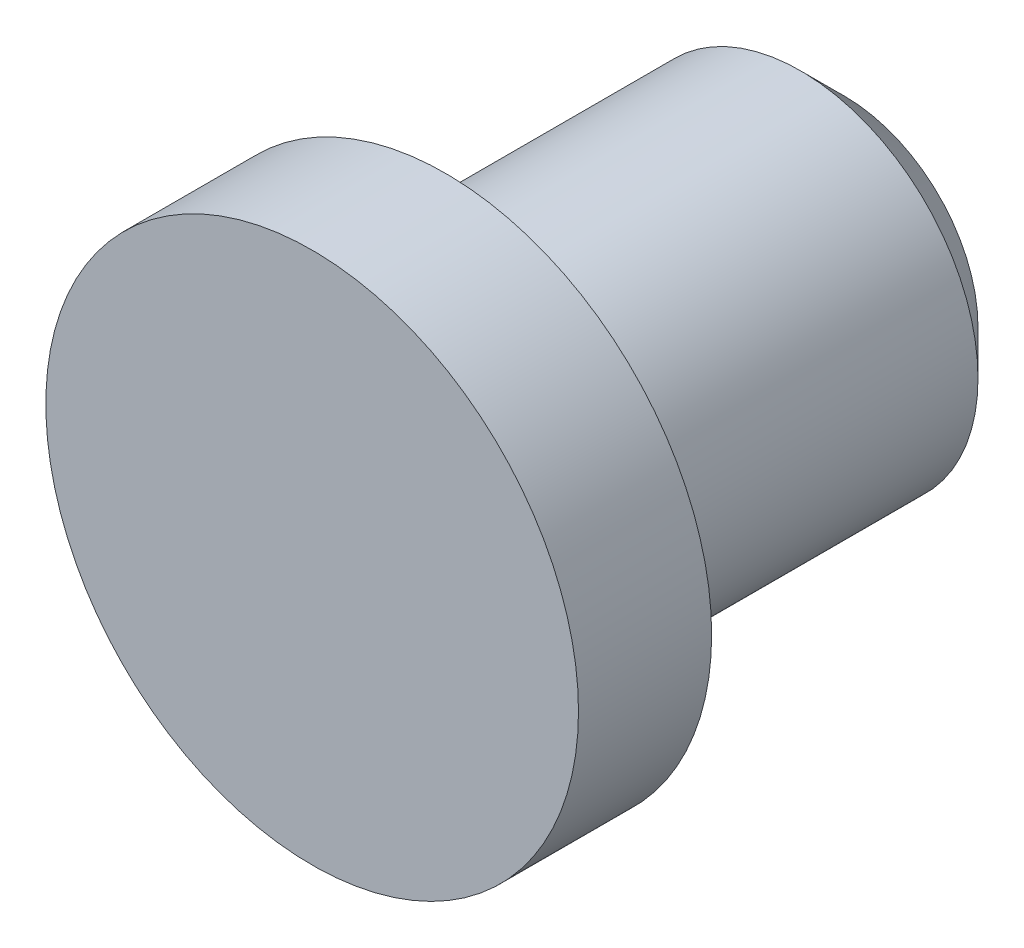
from build123d import *

# Parameters (mm, degrees)
ESQUISSE1_R        = 4
BOSS_EXTRU_1_DEPTH = 9
ESQUISSE2_R        = 6
BOSS_EXTRU_2_DEPTH = 3
CHANFREIN1_SIZE    = 1


with BuildPart() as part:
    # Esquisse1 → Boss.-Extru.1 (new body)
    with BuildSketch(Plane.XY):
        Circle(ESQUISSE1_R)
    extrude(amount=BOSS_EXTRU_1_DEPTH)

    # Esquisse2 → Boss.-Extru.2 (add)
    with BuildSketch(Plane.XY.offset(9)):
        Circle(ESQUISSE2_R)
    extrude(amount=BOSS_EXTRU_2_DEPTH)

    # Chanfrein1
    chanfrein1_edges = [part.edges().sort_by_distance(p)[0] for p in [
        (-4, 0, 0),
    ]]
    chamfer(chanfrein1_edges, length=CHANFREIN1_SIZE)


solid = part.part
